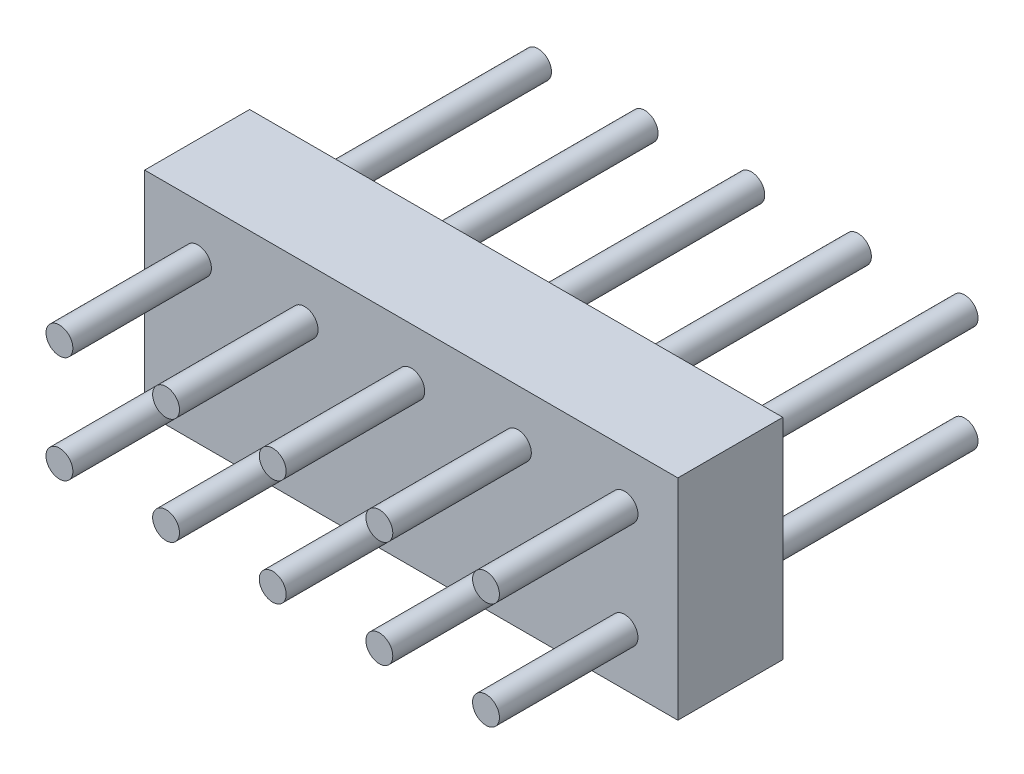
from build123d import *

# Parameters (mm, degrees)
SKETCH1_W           = 12.7
SKETCH1_H           = 5
BOSS_EXTRUDE1_DEPTH = 2.5
SKETCH2_R           = 0.32
BOSS_EXTRUDE2_DEPTH = 3.3
BOSS_EXTRUDE3_START = -8.1
SKETCH2_4_R         = 0.32
BOSS_EXTRUDE3_DEPTH = 5.6


with BuildPart() as part:
    # Sketch1 → Boss-Extrude1 (new body)
    with BuildSketch(Plane.XY):
        with Locations((6.35, 2.5)):
            Rectangle(SKETCH1_W, SKETCH1_H)
    extrude(amount=BOSS_EXTRUDE1_DEPTH)

    # Sketch2 → Boss-Extrude2 (add)
    with BuildSketch(Plane.XY.offset(2.5)):
        with Locations(Location((1.27, 1.23, 0), (0, 0, 180))):
            Circle(SKETCH2_R)
        with Locations(Location((3.81, 1.23, 0), (0, 0, 180))):
            Circle(SKETCH2_R)
        with Locations(Location((6.35, 1.23, 0), (0, 0, 180))):
            Circle(SKETCH2_R)
        with Locations(Location((8.89, 1.23, 0), (0, 0, 180))):
            Circle(SKETCH2_R)
        with Locations(Location((11.43, 1.23, 0), (0, 0, 180))):
            Circle(SKETCH2_R)
        with Locations(Location((11.43, 3.77, 0), (0, 0, 180))):
            Circle(SKETCH2_R)
        with Locations(Location((8.89, 3.77, 0), (0, 0, 180))):
            Circle(SKETCH2_R)
        with Locations(Location((6.35, 3.77, 0), (0, 0, 180))):
            Circle(SKETCH2_R)
        with Locations(Location((3.81, 3.77, 0), (0, 0, 180))):
            Circle(SKETCH2_R)
        with Locations(Location((1.27, 3.77, 0), (0, 0, 180))):
            Circle(SKETCH2_R)
    extrude(amount=BOSS_EXTRUDE2_DEPTH)

    # Sketch2_4 → Boss-Extrude3 (add)
    with BuildSketch(Plane.XY.offset(2.5).offset(BOSS_EXTRUDE3_START)):
        with Locations(Location((1.27, 1.23, 0), (0, 0, 180))):
            Circle(SKETCH2_4_R)
        with Locations(Location((3.81, 1.23, 0), (0, 0, 180))):
            Circle(SKETCH2_4_R)
        with Locations(Location((6.35, 1.23, 0), (0, 0, 180))):
            Circle(SKETCH2_4_R)
        with Locations(Location((8.89, 1.23, 0), (0, 0, 180))):
            Circle(SKETCH2_4_R)
        with Locations(Location((11.43, 1.23, 0), (0, 0, 180))):
            Circle(SKETCH2_4_R)
        with Locations(Location((11.43, 3.77, 0), (0, 0, 180))):
            Circle(SKETCH2_4_R)
        with Locations(Location((8.89, 3.77, 0), (0, 0, 180))):
            Circle(SKETCH2_4_R)
        with Locations(Location((6.35, 3.77, 0), (0, 0, 180))):
            Circle(SKETCH2_4_R)
        with Locations(Location((3.81, 3.77, 0), (0, 0, 180))):
            Circle(SKETCH2_4_R)
        with Locations(Location((1.27, 3.77, 0), (0, 0, 180))):
            Circle(SKETCH2_4_R)
    extrude(amount=BOSS_EXTRUDE3_DEPTH)


solid = part.part
